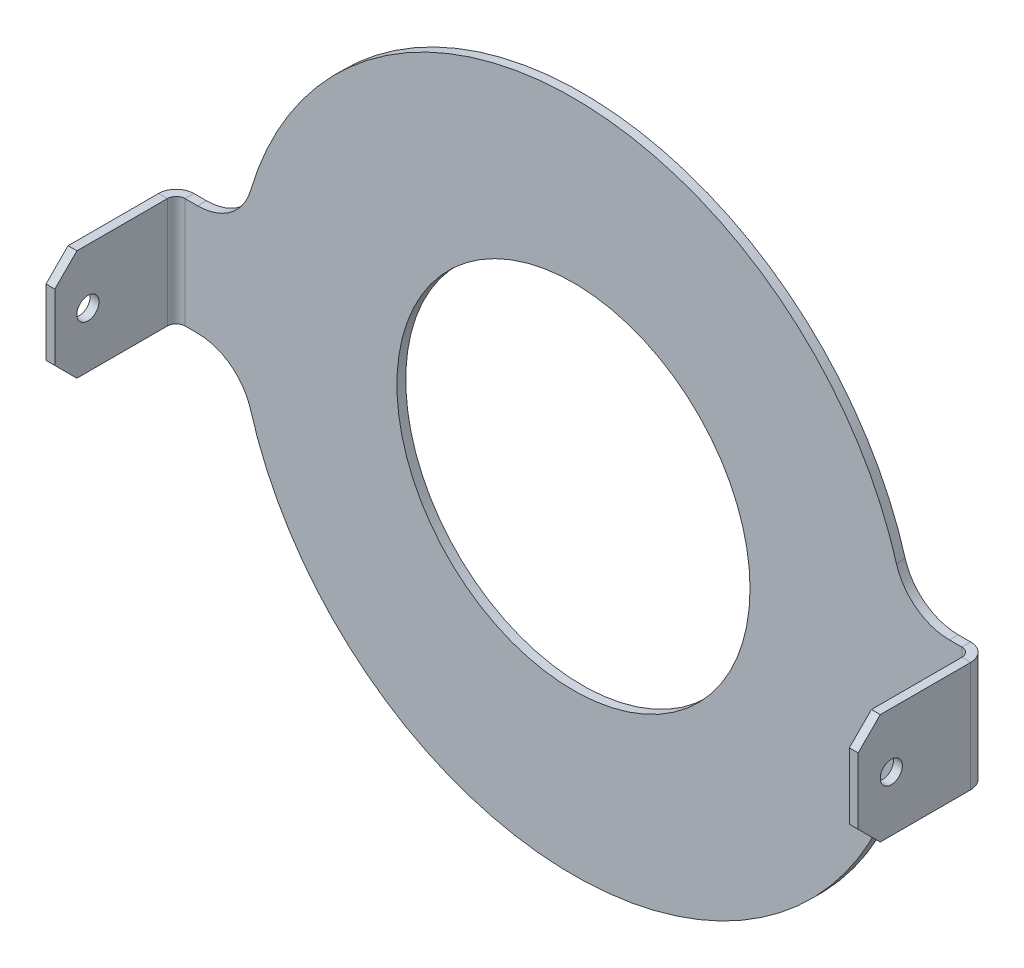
ISO-10303-21;
HEADER;
FILE_DESCRIPTION(('STEP AP214'),'2;1');
FILE_NAME('part.step','',(''),(''),'','','');
FILE_SCHEMA(('AUTOMOTIVE_DESIGN { 1 0 10303 214 1 1 1 1 }'));
ENDSEC;
DATA;
#1=APPLICATION_CONTEXT('core data for automotive mechanical design processes');
#2=APPLICATION_PROTOCOL_DEFINITION('international standard','automotive_design',2000,#1);
#3=PRODUCT_CONTEXT('',#1,'mechanical');
#4=PRODUCT('Part','Part','',(#3));
#5=PRODUCT_RELATED_PRODUCT_CATEGORY('part','',(#4));
#6=PRODUCT_DEFINITION_FORMATION('','',#4);
#7=PRODUCT_DEFINITION_CONTEXT('part definition',#1,'design');
#8=PRODUCT_DEFINITION('design','',#6,#7);
#9=PRODUCT_DEFINITION_SHAPE('','',#8);
#10=(LENGTH_UNIT() NAMED_UNIT(*) SI_UNIT(.MILLI.,.METRE.));
#11=(NAMED_UNIT(*) PLANE_ANGLE_UNIT() SI_UNIT($,.RADIAN.));
#12=(NAMED_UNIT(*) SI_UNIT($,.STERADIAN.) SOLID_ANGLE_UNIT());
#13=UNCERTAINTY_MEASURE_WITH_UNIT(LENGTH_MEASURE(1.E-05),#10,'distance_accuracy_value','');
#14=(GEOMETRIC_REPRESENTATION_CONTEXT(3) GLOBAL_UNCERTAINTY_ASSIGNED_CONTEXT((#13)) GLOBAL_UNIT_ASSIGNED_CONTEXT((#10,
#11,#12)) REPRESENTATION_CONTEXT('',''));
#15=CARTESIAN_POINT('',(0.,0.,0.));
#16=DIRECTION('',(0.,0.,1.));
#17=DIRECTION('',(1.,0.,0.));
#18=AXIS2_PLACEMENT_3D('',#15,#16,#17);
#19=CARTESIAN_POINT('',(0.,0.,4.));
#20=DIRECTION('',(0.,0.,1.));
#21=DIRECTION('',(1.,0.,0.));
#22=AXIS2_PLACEMENT_3D('',#19,#20,#21);
#23=PLANE('',#22);
#24=CARTESIAN_POINT('',(0.,0.,4.));
#25=DIRECTION('',(0.,0.,1.));
#26=DIRECTION('',(1.,0.,0.));
#27=AXIS2_PLACEMENT_3D('',#24,#25,#26);
#28=CIRCLE('',#27,80.);
#29=CARTESIAN_POINT('',(80.,0.,4.));
#30=VERTEX_POINT('',#29);
#31=EDGE_CURVE('E291',#30,#30,#28,.T.);
#32=ORIENTED_EDGE('',*,*,#31,.F.);
#33=EDGE_LOOP('',(#32));
#34=FACE_BOUND('',#33,.T.);
#35=DIRECTION('',(-1.,0.,0.));
#36=VECTOR('',#35,1.);
#37=CARTESIAN_POINT('',(235.,-25.,4.));
#38=LINE('',#37,#36);
#39=CARTESIAN_POINT('',(175.997610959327,-25.,4.));
#40=VERTEX_POINT('',#39);
#41=CARTESIAN_POINT('',(170.312213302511,-25.,4.));
#42=VERTEX_POINT('',#41);
#43=EDGE_CURVE('E289',#40,#42,#38,.T.);
#44=ORIENTED_EDGE('',*,*,#43,.F.);
#45=DIRECTION('',(0.,1.,0.));
#46=VECTOR('',#45,1.);
#47=CARTESIAN_POINT('',(175.997610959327,0.,4.));
#48=LINE('',#47,#46);
#49=CARTESIAN_POINT('',(175.997610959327,25.,4.));
#50=VERTEX_POINT('',#49);
#51=EDGE_CURVE('E242',#40,#50,#48,.T.);
#52=ORIENTED_EDGE('',*,*,#51,.T.);
#53=DIRECTION('',(1.,0.,0.));
#54=VECTOR('',#53,1.);
#55=CARTESIAN_POINT('',(235.,25.,4.));
#56=LINE('',#55,#54);
#57=CARTESIAN_POINT('',(170.312213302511,25.,4.));
#58=VERTEX_POINT('',#57);
#59=EDGE_CURVE('E338',#58,#50,#56,.T.);
#60=ORIENTED_EDGE('',*,*,#59,.F.);
#61=CARTESIAN_POINT('',(170.312213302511,50.,4.));
#62=DIRECTION('',(0.,0.,1.));
#63=DIRECTION('',(1.,0.,0.));
#64=AXIS2_PLACEMENT_3D('',#61,#62,#63);
#65=CIRCLE('',#64,25.);
#66=CARTESIAN_POINT('',(146.324577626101,42.9577464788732,4.));
#67=VERTEX_POINT('',#66);
#68=EDGE_CURVE('E397',#58,#67,#65,.F.);
#69=ORIENTED_EDGE('',*,*,#68,.T.);
#70=CARTESIAN_POINT('',(0.,0.,4.));
#71=DIRECTION('',(0.,0.,1.));
#72=DIRECTION('',(1.,0.,0.));
#73=AXIS2_PLACEMENT_3D('',#70,#71,#72);
#74=CIRCLE('',#73,152.5);
#75=CARTESIAN_POINT('',(-146.324577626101,42.9577464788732,4.));
#76=VERTEX_POINT('',#75);
#77=EDGE_CURVE('E279',#67,#76,#74,.T.);
#78=ORIENTED_EDGE('',*,*,#77,.T.);
#79=CARTESIAN_POINT('',(-170.312213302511,50.,4.));
#80=DIRECTION('',(0.,0.,1.));
#81=DIRECTION('',(1.,0.,0.));
#82=AXIS2_PLACEMENT_3D('',#79,#80,#81);
#83=CIRCLE('',#82,25.);
#84=CARTESIAN_POINT('',(-170.312213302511,25.,4.));
#85=VERTEX_POINT('',#84);
#86=EDGE_CURVE('E405',#76,#85,#83,.F.);
#87=ORIENTED_EDGE('',*,*,#86,.T.);
#88=DIRECTION('',(-1.,0.,0.));
#89=VECTOR('',#88,1.);
#90=CARTESIAN_POINT('',(-235.,25.,4.));
#91=LINE('',#90,#89);
#92=CARTESIAN_POINT('',(-175.997610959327,25.,4.));
#93=VERTEX_POINT('',#92);
#94=EDGE_CURVE('E277',#85,#93,#91,.T.);
#95=ORIENTED_EDGE('',*,*,#94,.T.);
#96=DIRECTION('',(0.,1.,0.));
#97=VECTOR('',#96,1.);
#98=CARTESIAN_POINT('',(-175.997610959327,0.,4.));
#99=LINE('',#98,#97);
#100=CARTESIAN_POINT('',(-175.997610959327,-25.,4.));
#101=VERTEX_POINT('',#100);
#102=EDGE_CURVE('E259',#101,#93,#99,.T.);
#103=ORIENTED_EDGE('',*,*,#102,.F.);
#104=DIRECTION('',(1.,0.,0.));
#105=VECTOR('',#104,1.);
#106=CARTESIAN_POINT('',(-235.,-25.,4.));
#107=LINE('',#106,#105);
#108=CARTESIAN_POINT('',(-170.312213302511,-25.,4.));
#109=VERTEX_POINT('',#108);
#110=EDGE_CURVE('E283',#101,#109,#107,.T.);
#111=ORIENTED_EDGE('',*,*,#110,.T.);
#112=CARTESIAN_POINT('',(-170.312213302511,-50.,4.));
#113=DIRECTION('',(0.,0.,1.));
#114=DIRECTION('',(1.,0.,0.));
#115=AXIS2_PLACEMENT_3D('',#112,#113,#114);
#116=CIRCLE('',#115,25.);
#117=CARTESIAN_POINT('',(-146.324577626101,-42.9577464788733,4.));
#118=VERTEX_POINT('',#117);
#119=EDGE_CURVE('E52',#109,#118,#116,.F.);
#120=ORIENTED_EDGE('',*,*,#119,.T.);
#121=CARTESIAN_POINT('',(146.324577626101,-42.9577464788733,4.));
#122=VERTEX_POINT('',#121);
#123=EDGE_CURVE('E280',#118,#122,#74,.T.);
#124=ORIENTED_EDGE('',*,*,#123,.T.);
#125=CARTESIAN_POINT('',(170.312213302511,-50.,4.));
#126=DIRECTION('',(0.,0.,1.));
#127=DIRECTION('',(1.,0.,0.));
#128=AXIS2_PLACEMENT_3D('',#125,#126,#127);
#129=CIRCLE('',#128,25.);
#130=EDGE_CURVE('E401',#122,#42,#129,.F.);
#131=ORIENTED_EDGE('',*,*,#130,.T.);
#132=EDGE_LOOP('',(#44,#52,#60,#69,#78,#87,#95,#103,#111,#120,#124,#131));
#133=FACE_BOUND('',#132,.T.);
#134=ADVANCED_FACE('F44',(#34,#133),#23,.T.);
#135=CARTESIAN_POINT('',(-179.997610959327,0.,-176.002389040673));
#136=DIRECTION('',(1.,0.,0.));
#137=DIRECTION('',(0.,0.,-1.));
#138=AXIS2_PLACEMENT_3D('',#135,#136,#137);
#139=PLANE('',#138);
#140=CARTESIAN_POINT('',(-179.997610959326,0.,43.9976109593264));
#141=DIRECTION('',(1.,0.,0.));
#142=DIRECTION('',(0.,0.,-1.));
#143=AXIS2_PLACEMENT_3D('',#140,#141,#142);
#144=CIRCLE('',#143,5.);
#145=CARTESIAN_POINT('',(-179.997610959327,0.,38.9976109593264));
#146=VERTEX_POINT('',#145);
#147=EDGE_CURVE('E227',#146,#146,#144,.T.);
#148=ORIENTED_EDGE('',*,*,#147,.F.);
#149=EDGE_LOOP('',(#148));
#150=FACE_BOUND('',#149,.T.);
#151=DIRECTION('',(0.,-1.,0.));
#152=VECTOR('',#151,1.);
#153=CARTESIAN_POINT('',(-179.997610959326,25.,58.9976109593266));
#154=LINE('',#153,#152);
#155=CARTESIAN_POINT('',(-179.997610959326,15.,58.9976109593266));
#156=VERTEX_POINT('',#155);
#157=CARTESIAN_POINT('',(-179.997610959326,-15.0000000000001,58.9976109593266));
#158=VERTEX_POINT('',#157);
#159=EDGE_CURVE('E266',#156,#158,#154,.T.);
#160=ORIENTED_EDGE('',*,*,#159,.T.);
#161=DIRECTION('',(0.,0.707106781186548,0.707106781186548));
#162=VECTOR('',#161,1.);
#163=CARTESIAN_POINT('',(-179.997610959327,-125.,-51.0023890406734));
#164=LINE('',#163,#162);
#165=CARTESIAN_POINT('',(-179.997610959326,-25.,48.9976109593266));
#166=VERTEX_POINT('',#165);
#167=EDGE_CURVE('E356',#158,#166,#164,.F.);
#168=ORIENTED_EDGE('',*,*,#167,.T.);
#169=DIRECTION('',(0.,0.,-1.));
#170=VECTOR('',#169,1.);
#171=CARTESIAN_POINT('',(-179.997610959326,-25.,58.9976109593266));
#172=LINE('',#171,#170);
#173=CARTESIAN_POINT('',(-179.997610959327,-25.,8.00000000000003));
#174=VERTEX_POINT('',#173);
#175=EDGE_CURVE('E309',#166,#174,#172,.T.);
#176=ORIENTED_EDGE('',*,*,#175,.T.);
#177=DIRECTION('',(0.,1.,0.));
#178=VECTOR('',#177,1.);
#179=CARTESIAN_POINT('',(-179.997610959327,0.,8.00000000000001));
#180=LINE('',#179,#178);
#181=CARTESIAN_POINT('',(-179.997610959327,25.,8.00000000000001));
#182=VERTEX_POINT('',#181);
#183=EDGE_CURVE('E310',#174,#182,#180,.T.);
#184=ORIENTED_EDGE('',*,*,#183,.T.);
#185=DIRECTION('',(0.,0.,1.));
#186=VECTOR('',#185,1.);
#187=CARTESIAN_POINT('',(-179.997610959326,25.,58.9976109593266));
#188=LINE('',#187,#186);
#189=CARTESIAN_POINT('',(-179.997610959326,25.,48.9976109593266));
#190=VERTEX_POINT('',#189);
#191=EDGE_CURVE('E306',#182,#190,#188,.T.);
#192=ORIENTED_EDGE('',*,*,#191,.T.);
#193=DIRECTION('',(0.,0.707106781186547,-0.707106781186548));
#194=VECTOR('',#193,1.);
#195=CARTESIAN_POINT('',(-179.997610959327,125.,-51.0023890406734));
#196=LINE('',#195,#194);
#197=EDGE_CURVE('E347',#190,#156,#196,.F.);
#198=ORIENTED_EDGE('',*,*,#197,.T.);
#199=EDGE_LOOP('',(#160,#168,#176,#184,#192,#198));
#200=FACE_BOUND('',#199,.T.);
#201=ADVANCED_FACE('F448',(#150,#200),#139,.T.);
#202=CARTESIAN_POINT('',(-183.997610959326,25.,58.9976109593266));
#203=DIRECTION('',(0.,1.,0.));
#204=DIRECTION('',(0.,0.,1.));
#205=AXIS2_PLACEMENT_3D('',#202,#203,#204);
#206=PLANE('',#205);
#207=DIRECTION('',(0.,0.,1.));
#208=VECTOR('',#207,1.);
#209=CARTESIAN_POINT('',(-183.997610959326,25.,58.9976109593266));
#210=LINE('',#209,#208);
#211=CARTESIAN_POINT('',(-183.997610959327,25.,8.00000000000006));
#212=VERTEX_POINT('',#211);
#213=CARTESIAN_POINT('',(-183.997610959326,25.,48.9976109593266));
#214=VERTEX_POINT('',#213);
#215=EDGE_CURVE('E314',#212,#214,#210,.T.);
#216=ORIENTED_EDGE('',*,*,#215,.T.);
#217=DIRECTION('',(1.,0.,0.));
#218=VECTOR('',#217,1.);
#219=CARTESIAN_POINT('',(-183.997610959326,25.,48.9976109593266));
#220=LINE('',#219,#218);
#221=EDGE_CURVE('E337',#214,#190,#220,.T.);
#222=ORIENTED_EDGE('',*,*,#221,.T.);
#223=ORIENTED_EDGE('',*,*,#191,.F.);
#224=DIRECTION('',(-1.,0.,0.));
#225=VECTOR('',#224,1.);
#226=CARTESIAN_POINT('',(-183.997610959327,25.,8.00000000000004));
#227=LINE('',#226,#225);
#228=EDGE_CURVE('E319',#182,#212,#227,.T.);
#229=ORIENTED_EDGE('',*,*,#228,.T.);
#230=EDGE_LOOP('',(#216,#222,#223,#229));
#231=FACE_BOUND('',#230,.T.);
#232=ADVANCED_FACE('F445',(#231),#206,.T.);
#233=CARTESIAN_POINT('',(-183.997610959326,-25.,58.9976109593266));
#234=DIRECTION('',(0.,-1.,0.));
#235=DIRECTION('',(0.,0.,-1.));
#236=AXIS2_PLACEMENT_3D('',#233,#234,#235);
#237=PLANE('',#236);
#238=ORIENTED_EDGE('',*,*,#175,.F.);
#239=DIRECTION('',(-1.,0.,0.));
#240=VECTOR('',#239,1.);
#241=CARTESIAN_POINT('',(-183.997610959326,-25.,48.9976109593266));
#242=LINE('',#241,#240);
#243=CARTESIAN_POINT('',(-183.997610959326,-25.,48.9976109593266));
#244=VERTEX_POINT('',#243);
#245=EDGE_CURVE('E358',#166,#244,#242,.T.);
#246=ORIENTED_EDGE('',*,*,#245,.T.);
#247=DIRECTION('',(0.,0.,-1.));
#248=VECTOR('',#247,1.);
#249=CARTESIAN_POINT('',(-183.997610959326,-25.,58.9976109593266));
#250=LINE('',#249,#248);
#251=CARTESIAN_POINT('',(-183.997610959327,-25.,8.00000000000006));
#252=VERTEX_POINT('',#251);
#253=EDGE_CURVE('E305',#244,#252,#250,.T.);
#254=ORIENTED_EDGE('',*,*,#253,.T.);
#255=DIRECTION('',(1.,0.,0.));
#256=VECTOR('',#255,1.);
#257=CARTESIAN_POINT('',(-183.997610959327,-25.,8.00000000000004));
#258=LINE('',#257,#256);
#259=EDGE_CURVE('E313',#252,#174,#258,.T.);
#260=ORIENTED_EDGE('',*,*,#259,.T.);
#261=EDGE_LOOP('',(#238,#246,#254,#260));
#262=FACE_BOUND('',#261,.T.);
#263=ADVANCED_FACE('F457',(#262),#237,.T.);
#264=CARTESIAN_POINT('',(-183.997610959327,0.,-176.002389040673));
#265=DIRECTION('',(1.,0.,0.));
#266=DIRECTION('',(0.,0.,-1.));
#267=AXIS2_PLACEMENT_3D('',#264,#265,#266);
#268=PLANE('',#267);
#269=CARTESIAN_POINT('',(-183.997610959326,0.,43.9976109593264));
#270=DIRECTION('',(-1.,0.,0.));
#271=DIRECTION('',(0.,0.,1.));
#272=AXIS2_PLACEMENT_3D('',#269,#270,#271);
#273=CIRCLE('',#272,5.);
#274=CARTESIAN_POINT('',(-183.997610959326,0.,48.9976109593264));
#275=VERTEX_POINT('',#274);
#276=EDGE_CURVE('E542',#275,#275,#273,.T.);
#277=ORIENTED_EDGE('',*,*,#276,.F.);
#278=EDGE_LOOP('',(#277));
#279=FACE_BOUND('',#278,.T.);
#280=ORIENTED_EDGE('',*,*,#253,.F.);
#281=DIRECTION('',(0.,-0.707106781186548,-0.707106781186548));
#282=VECTOR('',#281,1.);
#283=CARTESIAN_POINT('',(-183.997610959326,-15.,58.9976109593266));
#284=LINE('',#283,#282);
#285=CARTESIAN_POINT('',(-183.997610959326,-15.,58.9976109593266));
#286=VERTEX_POINT('',#285);
#287=EDGE_CURVE('E360',#244,#286,#284,.F.);
#288=ORIENTED_EDGE('',*,*,#287,.T.);
#289=DIRECTION('',(0.,-1.,0.));
#290=VECTOR('',#289,1.);
#291=CARTESIAN_POINT('',(-183.997610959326,25.,58.9976109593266));
#292=LINE('',#291,#290);
#293=CARTESIAN_POINT('',(-183.997610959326,15.,58.9976109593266));
#294=VERTEX_POINT('',#293);
#295=EDGE_CURVE('E302',#294,#286,#292,.T.);
#296=ORIENTED_EDGE('',*,*,#295,.F.);
#297=DIRECTION('',(0.,-0.707106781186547,0.707106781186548));
#298=VECTOR('',#297,1.);
#299=CARTESIAN_POINT('',(-183.997610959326,25.,48.9976109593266));
#300=LINE('',#299,#298);
#301=EDGE_CURVE('E351',#294,#214,#300,.F.);
#302=ORIENTED_EDGE('',*,*,#301,.T.);
#303=ORIENTED_EDGE('',*,*,#215,.F.);
#304=DIRECTION('',(0.,1.,0.));
#305=VECTOR('',#304,1.);
#306=CARTESIAN_POINT('',(-183.997610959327,0.,8.00000000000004));
#307=LINE('',#306,#305);
#308=EDGE_CURVE('E317',#252,#212,#307,.T.);
#309=ORIENTED_EDGE('',*,*,#308,.F.);
#310=EDGE_LOOP('',(#280,#288,#296,#302,#303,#309));
#311=FACE_BOUND('',#310,.T.);
#312=ADVANCED_FACE('F438',(#279,#311),#268,.F.);
#313=CARTESIAN_POINT('',(-183.997610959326,25.,58.9976109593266));
#314=DIRECTION('',(0.,0.,1.));
#315=DIRECTION('',(1.,0.,0.));
#316=AXIS2_PLACEMENT_3D('',#313,#314,#315);
#317=PLANE('',#316);
#318=ORIENTED_EDGE('',*,*,#295,.T.);
#319=DIRECTION('',(1.,0.,0.));
#320=VECTOR('',#319,1.);
#321=CARTESIAN_POINT('',(-183.997610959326,-15.,58.9976109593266));
#322=LINE('',#321,#320);
#323=EDGE_CURVE('E353',#286,#158,#322,.T.);
#324=ORIENTED_EDGE('',*,*,#323,.T.);
#325=ORIENTED_EDGE('',*,*,#159,.F.);
#326=DIRECTION('',(-1.,0.,0.));
#327=VECTOR('',#326,1.);
#328=CARTESIAN_POINT('',(-183.997610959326,15.,58.9976109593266));
#329=LINE('',#328,#327);
#330=EDGE_CURVE('E349',#156,#294,#329,.T.);
#331=ORIENTED_EDGE('',*,*,#330,.T.);
#332=EDGE_LOOP('',(#318,#324,#325,#331));
#333=FACE_BOUND('',#332,.T.);
#334=ADVANCED_FACE('F463',(#333),#317,.T.);
#335=CARTESIAN_POINT('',(0.,0.,0.));
#336=DIRECTION('',(0.,0.,1.));
#337=DIRECTION('',(1.,0.,0.));
#338=AXIS2_PLACEMENT_3D('',#335,#336,#337);
#339=CYLINDRICAL_SURFACE('',#338,80.);
#340=CARTESIAN_POINT('',(0.,0.,0.));
#341=DIRECTION('',(0.,0.,1.));
#342=DIRECTION('',(1.,0.,0.));
#343=AXIS2_PLACEMENT_3D('',#340,#341,#342);
#344=CIRCLE('',#343,80.);
#345=CARTESIAN_POINT('',(80.,0.,0.));
#346=VERTEX_POINT('',#345);
#347=EDGE_CURVE('E272',#346,#346,#344,.T.);
#348=ORIENTED_EDGE('',*,*,#347,.F.);
#349=EDGE_LOOP('',(#348));
#350=FACE_BOUND('',#349,.T.);
#351=ORIENTED_EDGE('',*,*,#31,.T.);
#352=EDGE_LOOP('',(#351));
#353=FACE_BOUND('',#352,.T.);
#354=ADVANCED_FACE('F506',(#350,#353),#339,.F.);
#355=CARTESIAN_POINT('',(0.,0.,4.));
#356=DIRECTION('',(0.,0.,-1.));
#357=DIRECTION('',(-1.,0.,0.));
#358=AXIS2_PLACEMENT_3D('',#355,#356,#357);
#359=CYLINDRICAL_SURFACE('',#358,152.5);
#360=ORIENTED_EDGE('',*,*,#77,.F.);
#361=DIRECTION('',(0.,0.,-1.));
#362=VECTOR('',#361,1.);
#363=CARTESIAN_POINT('',(146.324577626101,42.9577464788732,4.));
#364=LINE('',#363,#362);
#365=CARTESIAN_POINT('',(146.324577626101,42.9577464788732,0.));
#366=VERTEX_POINT('',#365);
#367=EDGE_CURVE('E384',#67,#366,#364,.T.);
#368=ORIENTED_EDGE('',*,*,#367,.T.);
#369=CARTESIAN_POINT('',(0.,0.,0.));
#370=DIRECTION('',(0.,0.,1.));
#371=DIRECTION('',(1.,0.,0.));
#372=AXIS2_PLACEMENT_3D('',#369,#370,#371);
#373=CIRCLE('',#372,152.5);
#374=CARTESIAN_POINT('',(-146.324577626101,42.9577464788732,0.));
#375=VERTEX_POINT('',#374);
#376=EDGE_CURVE('E290',#366,#375,#373,.T.);
#377=ORIENTED_EDGE('',*,*,#376,.T.);
#378=DIRECTION('',(0.,0.,-1.));
#379=VECTOR('',#378,1.);
#380=CARTESIAN_POINT('',(-146.324577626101,42.9577464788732,4.));
#381=LINE('',#380,#379);
#382=EDGE_CURVE('E381',#375,#76,#381,.F.);
#383=ORIENTED_EDGE('',*,*,#382,.T.);
#384=EDGE_LOOP('',(#360,#368,#377,#383));
#385=FACE_BOUND('',#384,.T.);
#386=ADVANCED_FACE('F501',(#385),#359,.T.);
#387=CARTESIAN_POINT('',(235.,25.,0.));
#388=DIRECTION('',(0.,-1.,0.));
#389=DIRECTION('',(1.,0.,0.));
#390=AXIS2_PLACEMENT_3D('',#387,#388,#389);
#391=PLANE('',#390);
#392=DIRECTION('',(1.,0.,0.));
#393=VECTOR('',#392,1.);
#394=CARTESIAN_POINT('',(235.,25.,0.));
#395=LINE('',#394,#393);
#396=CARTESIAN_POINT('',(170.312213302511,25.,0.));
#397=VERTEX_POINT('',#396);
#398=CARTESIAN_POINT('',(175.997610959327,25.,0.));
#399=VERTEX_POINT('',#398);
#400=EDGE_CURVE('E271',#397,#399,#395,.T.);
#401=ORIENTED_EDGE('',*,*,#400,.F.);
#402=DIRECTION('',(0.,0.,1.));
#403=VECTOR('',#402,1.);
#404=CARTESIAN_POINT('',(170.312213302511,25.,4.));
#405=LINE('',#404,#403);
#406=EDGE_CURVE('E378',#397,#58,#405,.T.);
#407=ORIENTED_EDGE('',*,*,#406,.T.);
#408=ORIENTED_EDGE('',*,*,#59,.T.);
#409=DIRECTION('',(0.,0.,1.));
#410=VECTOR('',#409,1.);
#411=CARTESIAN_POINT('',(175.997610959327,25.,0.));
#412=LINE('',#411,#410);
#413=EDGE_CURVE('E334',#399,#50,#412,.T.);
#414=ORIENTED_EDGE('',*,*,#413,.F.);
#415=EDGE_LOOP('',(#401,#407,#408,#414));
#416=FACE_BOUND('',#415,.T.);
#417=ADVANCED_FACE('F496',(#416),#391,.F.);
#418=CARTESIAN_POINT('',(235.,-25.,0.));
#419=DIRECTION('',(0.,1.,0.));
#420=DIRECTION('',(-1.,0.,0.));
#421=AXIS2_PLACEMENT_3D('',#418,#419,#420);
#422=PLANE('',#421);
#423=ORIENTED_EDGE('',*,*,#43,.T.);
#424=DIRECTION('',(0.,0.,1.));
#425=VECTOR('',#424,1.);
#426=CARTESIAN_POINT('',(170.312213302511,-25.,0.));
#427=LINE('',#426,#425);
#428=CARTESIAN_POINT('',(170.312213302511,-25.,0.));
#429=VERTEX_POINT('',#428);
#430=EDGE_CURVE('E391',#42,#429,#427,.F.);
#431=ORIENTED_EDGE('',*,*,#430,.T.);
#432=DIRECTION('',(-1.,0.,0.));
#433=VECTOR('',#432,1.);
#434=CARTESIAN_POINT('',(235.,-25.,0.));
#435=LINE('',#434,#433);
#436=CARTESIAN_POINT('',(175.997610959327,-25.,0.));
#437=VERTEX_POINT('',#436);
#438=EDGE_CURVE('E267',#437,#429,#435,.T.);
#439=ORIENTED_EDGE('',*,*,#438,.F.);
#440=DIRECTION('',(0.,0.,-1.));
#441=VECTOR('',#440,1.);
#442=CARTESIAN_POINT('',(175.997610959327,-25.,0.));
#443=LINE('',#442,#441);
#444=EDGE_CURVE('E329',#40,#437,#443,.T.);
#445=ORIENTED_EDGE('',*,*,#444,.F.);
#446=EDGE_LOOP('',(#423,#431,#439,#445));
#447=FACE_BOUND('',#446,.T.);
#448=ADVANCED_FACE('F493',(#447),#422,.F.);
#449=CARTESIAN_POINT('',(-146.324577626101,-42.9577464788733,0.));
#450=VERTEX_POINT('',#449);
#451=CARTESIAN_POINT('',(146.324577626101,-42.9577464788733,0.));
#452=VERTEX_POINT('',#451);
#453=EDGE_CURVE('E286',#450,#452,#373,.T.);
#454=ORIENTED_EDGE('',*,*,#453,.T.);
#455=DIRECTION('',(0.,0.,-1.));
#456=VECTOR('',#455,1.);
#457=CARTESIAN_POINT('',(146.324577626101,-42.9577464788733,4.));
#458=LINE('',#457,#456);
#459=EDGE_CURVE('E388',#452,#122,#458,.F.);
#460=ORIENTED_EDGE('',*,*,#459,.T.);
#461=ORIENTED_EDGE('',*,*,#123,.F.);
#462=DIRECTION('',(0.,0.,-1.));
#463=VECTOR('',#462,1.);
#464=CARTESIAN_POINT('',(-146.324577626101,-42.9577464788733,4.));
#465=LINE('',#464,#463);
#466=EDGE_CURVE('E386',#118,#450,#465,.T.);
#467=ORIENTED_EDGE('',*,*,#466,.T.);
#468=EDGE_LOOP('',(#454,#460,#461,#467));
#469=FACE_BOUND('',#468,.T.);
#470=ADVANCED_FACE('F412',(#469),#359,.T.);
#471=CARTESIAN_POINT('',(-235.,-25.,0.));
#472=DIRECTION('',(0.,-1.,0.));
#473=DIRECTION('',(1.,0.,0.));
#474=AXIS2_PLACEMENT_3D('',#471,#472,#473);
#475=PLANE('',#474);
#476=DIRECTION('',(1.,0.,0.));
#477=VECTOR('',#476,1.);
#478=CARTESIAN_POINT('',(-235.,-25.,0.));
#479=LINE('',#478,#477);
#480=CARTESIAN_POINT('',(-175.997610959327,-25.,0.));
#481=VERTEX_POINT('',#480);
#482=CARTESIAN_POINT('',(-170.312213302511,-25.,0.));
#483=VERTEX_POINT('',#482);
#484=EDGE_CURVE('E275',#481,#483,#479,.T.);
#485=ORIENTED_EDGE('',*,*,#484,.T.);
#486=DIRECTION('',(0.,0.,-1.));
#487=VECTOR('',#486,1.);
#488=CARTESIAN_POINT('',(-170.312213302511,-25.,0.));
#489=LINE('',#488,#487);
#490=EDGE_CURVE('E395',#483,#109,#489,.F.);
#491=ORIENTED_EDGE('',*,*,#490,.T.);
#492=ORIENTED_EDGE('',*,*,#110,.F.);
#493=DIRECTION('',(0.,0.,1.));
#494=VECTOR('',#493,1.);
#495=CARTESIAN_POINT('',(-175.997610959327,-25.,0.));
#496=LINE('',#495,#494);
#497=EDGE_CURVE('E294',#481,#101,#496,.T.);
#498=ORIENTED_EDGE('',*,*,#497,.F.);
#499=EDGE_LOOP('',(#485,#491,#492,#498));
#500=FACE_BOUND('',#499,.T.);
#501=ADVANCED_FACE('F415',(#500),#475,.T.);
#502=CARTESIAN_POINT('',(0.,0.,0.));
#503=DIRECTION('',(0.,0.,1.));
#504=DIRECTION('',(1.,0.,0.));
#505=AXIS2_PLACEMENT_3D('',#502,#503,#504);
#506=PLANE('',#505);
#507=DIRECTION('',(0.,1.,0.));
#508=VECTOR('',#507,1.);
#509=CARTESIAN_POINT('',(175.997610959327,0.,0.));
#510=LINE('',#509,#508);
#511=EDGE_CURVE('E331',#437,#399,#510,.T.);
#512=ORIENTED_EDGE('',*,*,#511,.F.);
#513=ORIENTED_EDGE('',*,*,#438,.T.);
#514=CARTESIAN_POINT('',(170.312213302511,-50.,0.));
#515=DIRECTION('',(0.,0.,1.));
#516=DIRECTION('',(1.,0.,0.));
#517=AXIS2_PLACEMENT_3D('',#514,#515,#516);
#518=CIRCLE('',#517,25.);
#519=EDGE_CURVE('E403',#429,#452,#518,.T.);
#520=ORIENTED_EDGE('',*,*,#519,.T.);
#521=ORIENTED_EDGE('',*,*,#453,.F.);
#522=CARTESIAN_POINT('',(-170.312213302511,-50.,0.));
#523=DIRECTION('',(0.,0.,1.));
#524=DIRECTION('',(1.,0.,0.));
#525=AXIS2_PLACEMENT_3D('',#522,#523,#524);
#526=CIRCLE('',#525,25.);
#527=EDGE_CURVE('E12',#450,#483,#526,.T.);
#528=ORIENTED_EDGE('',*,*,#527,.T.);
#529=ORIENTED_EDGE('',*,*,#484,.F.);
#530=DIRECTION('',(0.,1.,0.));
#531=VECTOR('',#530,1.);
#532=CARTESIAN_POINT('',(-175.997610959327,0.,0.));
#533=LINE('',#532,#531);
#534=CARTESIAN_POINT('',(-175.997610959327,25.,0.));
#535=VERTEX_POINT('',#534);
#536=EDGE_CURVE('E268',#481,#535,#533,.T.);
#537=ORIENTED_EDGE('',*,*,#536,.T.);
#538=DIRECTION('',(-1.,0.,0.));
#539=VECTOR('',#538,1.);
#540=CARTESIAN_POINT('',(-235.,25.,0.));
#541=LINE('',#540,#539);
#542=CARTESIAN_POINT('',(-170.312213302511,25.,0.));
#543=VERTEX_POINT('',#542);
#544=EDGE_CURVE('E264',#543,#535,#541,.T.);
#545=ORIENTED_EDGE('',*,*,#544,.F.);
#546=CARTESIAN_POINT('',(-170.312213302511,50.,0.));
#547=DIRECTION('',(0.,0.,1.));
#548=DIRECTION('',(1.,0.,0.));
#549=AXIS2_PLACEMENT_3D('',#546,#547,#548);
#550=CIRCLE('',#549,25.);
#551=EDGE_CURVE('E407',#543,#375,#550,.T.);
#552=ORIENTED_EDGE('',*,*,#551,.T.);
#553=ORIENTED_EDGE('',*,*,#376,.F.);
#554=CARTESIAN_POINT('',(170.312213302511,50.,0.));
#555=DIRECTION('',(0.,0.,1.));
#556=DIRECTION('',(1.,0.,0.));
#557=AXIS2_PLACEMENT_3D('',#554,#555,#556);
#558=CIRCLE('',#557,25.);
#559=EDGE_CURVE('E399',#366,#397,#558,.T.);
#560=ORIENTED_EDGE('',*,*,#559,.T.);
#561=ORIENTED_EDGE('',*,*,#400,.T.);
#562=EDGE_LOOP('',(#512,#513,#520,#521,#528,#529,#537,#545,#552,#553,#560,#561));
#563=FACE_BOUND('',#562,.T.);
#564=ORIENTED_EDGE('',*,*,#347,.T.);
#565=EDGE_LOOP('',(#564));
#566=FACE_BOUND('',#565,.T.);
#567=ADVANCED_FACE('F419',(#563,#566),#506,.F.);
#568=CARTESIAN_POINT('',(-235.,25.,0.));
#569=DIRECTION('',(0.,1.,0.));
#570=DIRECTION('',(-1.,0.,0.));
#571=AXIS2_PLACEMENT_3D('',#568,#569,#570);
#572=PLANE('',#571);
#573=ORIENTED_EDGE('',*,*,#94,.F.);
#574=DIRECTION('',(0.,0.,-1.));
#575=VECTOR('',#574,1.);
#576=CARTESIAN_POINT('',(-170.312213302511,25.,0.));
#577=LINE('',#576,#575);
#578=EDGE_CURVE('E393',#85,#543,#577,.T.);
#579=ORIENTED_EDGE('',*,*,#578,.T.);
#580=ORIENTED_EDGE('',*,*,#544,.T.);
#581=DIRECTION('',(0.,0.,-1.));
#582=VECTOR('',#581,1.);
#583=CARTESIAN_POINT('',(-175.997610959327,25.,0.));
#584=LINE('',#583,#582);
#585=EDGE_CURVE('E297',#93,#535,#584,.T.);
#586=ORIENTED_EDGE('',*,*,#585,.F.);
#587=EDGE_LOOP('',(#573,#579,#580,#586));
#588=FACE_BOUND('',#587,.T.);
#589=ADVANCED_FACE('F499',(#588),#572,.T.);
#590=CARTESIAN_POINT('',(-175.997610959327,-25.,8.));
#591=DIRECTION('',(0.,1.,0.));
#592=DIRECTION('',(0.,0.,1.));
#593=AXIS2_PLACEMENT_3D('',#590,#591,#592);
#594=PLANE('',#593);
#595=ORIENTED_EDGE('',*,*,#259,.F.);
#596=CARTESIAN_POINT('',(-175.997610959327,-25.,8.));
#597=DIRECTION('',(0.,-1.,0.));
#598=DIRECTION('',(0.,0.,-1.));
#599=AXIS2_PLACEMENT_3D('',#596,#597,#598);
#600=CIRCLE('',#599,8.);
#601=EDGE_CURVE('E246',#252,#481,#600,.T.);
#602=ORIENTED_EDGE('',*,*,#601,.T.);
#603=ORIENTED_EDGE('',*,*,#497,.T.);
#604=CARTESIAN_POINT('',(-175.997610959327,-25.,8.));
#605=DIRECTION('',(0.,-1.,0.));
#606=DIRECTION('',(0.,0.,-1.));
#607=AXIS2_PLACEMENT_3D('',#604,#605,#606);
#608=CIRCLE('',#607,4.);
#609=EDGE_CURVE('E253',#174,#101,#608,.T.);
#610=ORIENTED_EDGE('',*,*,#609,.F.);
#611=EDGE_LOOP('',(#595,#602,#603,#610));
#612=FACE_BOUND('',#611,.T.);
#613=ADVANCED_FACE('F455',(#612),#594,.F.);
#614=CARTESIAN_POINT('',(-175.997610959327,25.,8.));
#615=DIRECTION('',(0.,-1.,0.));
#616=DIRECTION('',(0.,0.,-1.));
#617=AXIS2_PLACEMENT_3D('',#614,#615,#616);
#618=PLANE('',#617);
#619=CARTESIAN_POINT('',(-175.997610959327,25.,8.));
#620=DIRECTION('',(0.,-1.,0.));
#621=DIRECTION('',(0.,0.,-1.));
#622=AXIS2_PLACEMENT_3D('',#619,#620,#621);
#623=CIRCLE('',#622,8.);
#624=EDGE_CURVE('E257',#535,#212,#623,.F.);
#625=ORIENTED_EDGE('',*,*,#624,.T.);
#626=ORIENTED_EDGE('',*,*,#228,.F.);
#627=CARTESIAN_POINT('',(-175.997610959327,25.,8.));
#628=DIRECTION('',(0.,1.,0.));
#629=DIRECTION('',(0.,0.,1.));
#630=AXIS2_PLACEMENT_3D('',#627,#628,#629);
#631=CIRCLE('',#630,4.);
#632=EDGE_CURVE('E256',#93,#182,#631,.T.);
#633=ORIENTED_EDGE('',*,*,#632,.F.);
#634=ORIENTED_EDGE('',*,*,#585,.T.);
#635=EDGE_LOOP('',(#625,#626,#633,#634));
#636=FACE_BOUND('',#635,.T.);
#637=ADVANCED_FACE('F429',(#636),#618,.F.);
#638=CARTESIAN_POINT('',(-175.997610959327,50.7944531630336,8.));
#639=DIRECTION('',(0.,-1.,0.));
#640=DIRECTION('',(0.,0.,-1.));
#641=AXIS2_PLACEMENT_3D('',#638,#639,#640);
#642=CYLINDRICAL_SURFACE('',#641,4.);
#643=ORIENTED_EDGE('',*,*,#102,.T.);
#644=ORIENTED_EDGE('',*,*,#632,.T.);
#645=ORIENTED_EDGE('',*,*,#183,.F.);
#646=ORIENTED_EDGE('',*,*,#609,.T.);
#647=EDGE_LOOP('',(#643,#644,#645,#646));
#648=FACE_BOUND('',#647,.T.);
#649=ADVANCED_FACE('F452',(#648),#642,.F.);
#650=CARTESIAN_POINT('',(-175.997610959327,50.7944531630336,8.));
#651=DIRECTION('',(0.,-1.,0.));
#652=DIRECTION('',(0.,0.,-1.));
#653=AXIS2_PLACEMENT_3D('',#650,#651,#652);
#654=CYLINDRICAL_SURFACE('',#653,8.);
#655=ORIENTED_EDGE('',*,*,#536,.F.);
#656=ORIENTED_EDGE('',*,*,#601,.F.);
#657=ORIENTED_EDGE('',*,*,#308,.T.);
#658=ORIENTED_EDGE('',*,*,#624,.F.);
#659=EDGE_LOOP('',(#655,#656,#657,#658));
#660=FACE_BOUND('',#659,.T.);
#661=ADVANCED_FACE('F434',(#660),#654,.T.);
#662=CARTESIAN_POINT('',(175.997610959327,-25.,8.));
#663=DIRECTION('',(0.,1.,0.));
#664=DIRECTION('',(0.,0.,1.));
#665=AXIS2_PLACEMENT_3D('',#662,#663,#664);
#666=PLANE('',#665);
#667=ORIENTED_EDGE('',*,*,#444,.T.);
#668=CARTESIAN_POINT('',(175.997610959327,-25.,8.));
#669=DIRECTION('',(0.,1.,0.));
#670=DIRECTION('',(0.,0.,1.));
#671=AXIS2_PLACEMENT_3D('',#668,#669,#670);
#672=CIRCLE('',#671,8.);
#673=CARTESIAN_POINT('',(183.997610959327,-25.,8.00000000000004));
#674=VERTEX_POINT('',#673);
#675=EDGE_CURVE('E236',#437,#674,#672,.F.);
#676=ORIENTED_EDGE('',*,*,#675,.T.);
#677=DIRECTION('',(1.,0.,0.));
#678=VECTOR('',#677,1.);
#679=CARTESIAN_POINT('',(183.997610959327,-25.,8.00000000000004));
#680=LINE('',#679,#678);
#681=CARTESIAN_POINT('',(179.997610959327,-25.,8.00000000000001));
#682=VERTEX_POINT('',#681);
#683=EDGE_CURVE('E210',#682,#674,#680,.T.);
#684=ORIENTED_EDGE('',*,*,#683,.F.);
#685=CARTESIAN_POINT('',(175.997610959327,-25.,8.));
#686=DIRECTION('',(0.,-1.,0.));
#687=DIRECTION('',(0.,0.,1.));
#688=AXIS2_PLACEMENT_3D('',#685,#686,#687);
#689=CIRCLE('',#688,4.);
#690=EDGE_CURVE('E234',#40,#682,#689,.T.);
#691=ORIENTED_EDGE('',*,*,#690,.F.);
#692=EDGE_LOOP('',(#667,#676,#684,#691));
#693=FACE_BOUND('',#692,.T.);
#694=ADVANCED_FACE('F233',(#693),#666,.F.);
#695=CARTESIAN_POINT('',(175.997610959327,25.,8.));
#696=DIRECTION('',(0.,-1.,0.));
#697=DIRECTION('',(0.,0.,-1.));
#698=AXIS2_PLACEMENT_3D('',#695,#696,#697);
#699=PLANE('',#698);
#700=CARTESIAN_POINT('',(175.997610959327,25.,8.));
#701=DIRECTION('',(0.,1.,0.));
#702=DIRECTION('',(0.,0.,1.));
#703=AXIS2_PLACEMENT_3D('',#700,#701,#702);
#704=CIRCLE('',#703,8.);
#705=CARTESIAN_POINT('',(183.997610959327,25.,8.00000000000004));
#706=VERTEX_POINT('',#705);
#707=EDGE_CURVE('E244',#706,#399,#704,.T.);
#708=ORIENTED_EDGE('',*,*,#707,.T.);
#709=ORIENTED_EDGE('',*,*,#413,.T.);
#710=CARTESIAN_POINT('',(175.997610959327,25.,8.));
#711=DIRECTION('',(0.,1.,0.));
#712=DIRECTION('',(0.,0.,-1.));
#713=AXIS2_PLACEMENT_3D('',#710,#711,#712);
#714=CIRCLE('',#713,4.);
#715=CARTESIAN_POINT('',(179.997610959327,25.,8.00000000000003));
#716=VERTEX_POINT('',#715);
#717=EDGE_CURVE('E243',#716,#50,#714,.T.);
#718=ORIENTED_EDGE('',*,*,#717,.F.);
#719=DIRECTION('',(-1.,0.,0.));
#720=VECTOR('',#719,1.);
#721=CARTESIAN_POINT('',(183.997610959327,25.,8.00000000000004));
#722=LINE('',#721,#720);
#723=EDGE_CURVE('E555',#706,#716,#722,.T.);
#724=ORIENTED_EDGE('',*,*,#723,.F.);
#725=EDGE_LOOP('',(#708,#709,#718,#724));
#726=FACE_BOUND('',#725,.T.);
#727=ADVANCED_FACE('F586',(#726),#699,.F.);
#728=CARTESIAN_POINT('',(175.997610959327,-50.7944531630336,8.));
#729=DIRECTION('',(0.,1.,0.));
#730=DIRECTION('',(0.,0.,1.));
#731=AXIS2_PLACEMENT_3D('',#728,#729,#730);
#732=CYLINDRICAL_SURFACE('',#731,4.);
#733=DIRECTION('',(0.,1.,0.));
#734=VECTOR('',#733,1.);
#735=CARTESIAN_POINT('',(179.997610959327,0.,8.00000000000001));
#736=LINE('',#735,#734);
#737=EDGE_CURVE('E219',#682,#716,#736,.T.);
#738=ORIENTED_EDGE('',*,*,#737,.T.);
#739=ORIENTED_EDGE('',*,*,#717,.T.);
#740=ORIENTED_EDGE('',*,*,#51,.F.);
#741=ORIENTED_EDGE('',*,*,#690,.T.);
#742=EDGE_LOOP('',(#738,#739,#740,#741));
#743=FACE_BOUND('',#742,.T.);
#744=ADVANCED_FACE('F240',(#743),#732,.F.);
#745=CARTESIAN_POINT('',(175.997610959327,-50.7944531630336,8.));
#746=DIRECTION('',(0.,1.,0.));
#747=DIRECTION('',(0.,0.,1.));
#748=AXIS2_PLACEMENT_3D('',#745,#746,#747);
#749=CYLINDRICAL_SURFACE('',#748,8.);
#750=DIRECTION('',(0.,1.,0.));
#751=VECTOR('',#750,1.);
#752=CARTESIAN_POINT('',(183.997610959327,0.,8.00000000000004));
#753=LINE('',#752,#751);
#754=EDGE_CURVE('E563',#674,#706,#753,.T.);
#755=ORIENTED_EDGE('',*,*,#754,.F.);
#756=ORIENTED_EDGE('',*,*,#675,.F.);
#757=ORIENTED_EDGE('',*,*,#511,.T.);
#758=ORIENTED_EDGE('',*,*,#707,.F.);
#759=EDGE_LOOP('',(#755,#756,#757,#758));
#760=FACE_BOUND('',#759,.T.);
#761=ADVANCED_FACE('F588',(#760),#749,.T.);
#762=CARTESIAN_POINT('',(183.997610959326,25.,58.9976109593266));
#763=DIRECTION('',(0.,0.,-1.));
#764=DIRECTION('',(-1.,0.,0.));
#765=AXIS2_PLACEMENT_3D('',#762,#763,#764);
#766=PLANE('',#765);
#767=DIRECTION('',(0.,-1.,0.));
#768=VECTOR('',#767,1.);
#769=CARTESIAN_POINT('',(179.997610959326,25.,58.9976109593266));
#770=LINE('',#769,#768);
#771=CARTESIAN_POINT('',(179.997610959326,15.,58.9976109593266));
#772=VERTEX_POINT('',#771);
#773=CARTESIAN_POINT('',(179.997610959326,-15.,58.9976109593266));
#774=VERTEX_POINT('',#773);
#775=EDGE_CURVE('E215',#772,#774,#770,.T.);
#776=ORIENTED_EDGE('',*,*,#775,.T.);
#777=DIRECTION('',(1.,0.,0.));
#778=VECTOR('',#777,1.);
#779=CARTESIAN_POINT('',(183.997610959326,-15.,58.9976109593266));
#780=LINE('',#779,#778);
#781=CARTESIAN_POINT('',(183.997610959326,-15.,58.9976109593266));
#782=VERTEX_POINT('',#781);
#783=EDGE_CURVE('E374',#774,#782,#780,.T.);
#784=ORIENTED_EDGE('',*,*,#783,.T.);
#785=DIRECTION('',(0.,-1.,0.));
#786=VECTOR('',#785,1.);
#787=CARTESIAN_POINT('',(183.997610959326,25.,58.9976109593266));
#788=LINE('',#787,#786);
#789=CARTESIAN_POINT('',(183.997610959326,15.,58.9976109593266));
#790=VERTEX_POINT('',#789);
#791=EDGE_CURVE('E557',#790,#782,#788,.T.);
#792=ORIENTED_EDGE('',*,*,#791,.F.);
#793=DIRECTION('',(-1.,0.,0.));
#794=VECTOR('',#793,1.);
#795=CARTESIAN_POINT('',(183.997610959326,15.,58.9976109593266));
#796=LINE('',#795,#794);
#797=EDGE_CURVE('E362',#790,#772,#796,.T.);
#798=ORIENTED_EDGE('',*,*,#797,.T.);
#799=EDGE_LOOP('',(#776,#784,#792,#798));
#800=FACE_BOUND('',#799,.T.);
#801=ADVANCED_FACE('F570',(#800),#766,.F.);
#802=CARTESIAN_POINT('',(179.997610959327,0.,-176.002389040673));
#803=DIRECTION('',(-1.,0.,0.));
#804=DIRECTION('',(0.,0.,1.));
#805=AXIS2_PLACEMENT_3D('',#802,#803,#804);
#806=PLANE('',#805);
#807=CARTESIAN_POINT('',(179.997610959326,0.,43.9976109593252));
#808=DIRECTION('',(-1.,0.,0.));
#809=DIRECTION('',(0.,0.,1.));
#810=AXIS2_PLACEMENT_3D('',#807,#808,#809);
#811=CIRCLE('',#810,5.);
#812=CARTESIAN_POINT('',(179.997610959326,0.,48.9976109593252));
#813=VERTEX_POINT('',#812);
#814=EDGE_CURVE('E547',#813,#813,#811,.T.);
#815=ORIENTED_EDGE('',*,*,#814,.F.);
#816=EDGE_LOOP('',(#815));
#817=FACE_BOUND('',#816,.T.);
#818=DIRECTION('',(0.,0.,-1.));
#819=VECTOR('',#818,1.);
#820=CARTESIAN_POINT('',(179.997610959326,-25.,58.9976109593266));
#821=LINE('',#820,#819);
#822=CARTESIAN_POINT('',(179.997610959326,-25.,48.9976109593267));
#823=VERTEX_POINT('',#822);
#824=EDGE_CURVE('E205',#823,#682,#821,.T.);
#825=ORIENTED_EDGE('',*,*,#824,.F.);
#826=DIRECTION('',(0.,-0.707106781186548,-0.707106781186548));
#827=VECTOR('',#826,1.);
#828=CARTESIAN_POINT('',(179.997610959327,-125.,-51.0023890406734));
#829=LINE('',#828,#827);
#830=EDGE_CURVE('E372',#823,#774,#829,.F.);
#831=ORIENTED_EDGE('',*,*,#830,.T.);
#832=ORIENTED_EDGE('',*,*,#775,.F.);
#833=DIRECTION('',(0.,-0.707106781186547,0.707106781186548));
#834=VECTOR('',#833,1.);
#835=CARTESIAN_POINT('',(179.997610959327,125.,-51.0023890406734));
#836=LINE('',#835,#834);
#837=CARTESIAN_POINT('',(179.997610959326,25.,48.9976109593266));
#838=VERTEX_POINT('',#837);
#839=EDGE_CURVE('E365',#772,#838,#836,.F.);
#840=ORIENTED_EDGE('',*,*,#839,.T.);
#841=DIRECTION('',(0.,0.,1.));
#842=VECTOR('',#841,1.);
#843=CARTESIAN_POINT('',(179.997610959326,25.,58.9976109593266));
#844=LINE('',#843,#842);
#845=EDGE_CURVE('E222',#716,#838,#844,.T.);
#846=ORIENTED_EDGE('',*,*,#845,.F.);
#847=ORIENTED_EDGE('',*,*,#737,.F.);
#848=EDGE_LOOP('',(#825,#831,#832,#840,#846,#847));
#849=FACE_BOUND('',#848,.T.);
#850=ADVANCED_FACE('F220',(#817,#849),#806,.T.);
#851=CARTESIAN_POINT('',(183.997610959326,-25.,58.9976109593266));
#852=DIRECTION('',(0.,1.,0.));
#853=DIRECTION('',(0.,0.,-1.));
#854=AXIS2_PLACEMENT_3D('',#851,#852,#853);
#855=PLANE('',#854);
#856=DIRECTION('',(0.,0.,-1.));
#857=VECTOR('',#856,1.);
#858=CARTESIAN_POINT('',(183.997610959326,-25.,58.9976109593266));
#859=LINE('',#858,#857);
#860=CARTESIAN_POINT('',(183.997610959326,-25.,48.9976109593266));
#861=VERTEX_POINT('',#860);
#862=EDGE_CURVE('E237',#861,#674,#859,.T.);
#863=ORIENTED_EDGE('',*,*,#862,.F.);
#864=DIRECTION('',(-1.,0.,0.));
#865=VECTOR('',#864,1.);
#866=CARTESIAN_POINT('',(183.997610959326,-25.,48.9976109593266));
#867=LINE('',#866,#865);
#868=EDGE_CURVE('E213',#861,#823,#867,.T.);
#869=ORIENTED_EDGE('',*,*,#868,.T.);
#870=ORIENTED_EDGE('',*,*,#824,.T.);
#871=ORIENTED_EDGE('',*,*,#683,.T.);
#872=EDGE_LOOP('',(#863,#869,#870,#871));
#873=FACE_BOUND('',#872,.T.);
#874=ADVANCED_FACE('F208',(#873),#855,.F.);
#875=CARTESIAN_POINT('',(183.997610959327,0.,-176.002389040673));
#876=DIRECTION('',(-1.,0.,0.));
#877=DIRECTION('',(0.,0.,1.));
#878=AXIS2_PLACEMENT_3D('',#875,#876,#877);
#879=PLANE('',#878);
#880=CARTESIAN_POINT('',(183.997610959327,0.,43.9976109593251));
#881=DIRECTION('',(-1.,0.,0.));
#882=DIRECTION('',(0.,0.,1.));
#883=AXIS2_PLACEMENT_3D('',#880,#881,#882);
#884=CIRCLE('',#883,5.);
#885=CARTESIAN_POINT('',(183.997610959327,0.,48.9976109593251));
#886=VERTEX_POINT('',#885);
#887=EDGE_CURVE('E544',#886,#886,#884,.T.);
#888=ORIENTED_EDGE('',*,*,#887,.T.);
#889=EDGE_LOOP('',(#888));
#890=FACE_BOUND('',#889,.T.);
#891=ORIENTED_EDGE('',*,*,#791,.T.);
#892=DIRECTION('',(0.,0.707106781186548,0.707106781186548));
#893=VECTOR('',#892,1.);
#894=CARTESIAN_POINT('',(183.997610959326,-25.,48.9976109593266));
#895=LINE('',#894,#893);
#896=EDGE_CURVE('E376',#782,#861,#895,.F.);
#897=ORIENTED_EDGE('',*,*,#896,.T.);
#898=ORIENTED_EDGE('',*,*,#862,.T.);
#899=ORIENTED_EDGE('',*,*,#754,.T.);
#900=DIRECTION('',(0.,0.,1.));
#901=VECTOR('',#900,1.);
#902=CARTESIAN_POINT('',(183.997610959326,25.,58.9976109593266));
#903=LINE('',#902,#901);
#904=CARTESIAN_POINT('',(183.997610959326,25.,48.9976109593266));
#905=VERTEX_POINT('',#904);
#906=EDGE_CURVE('E560',#706,#905,#903,.T.);
#907=ORIENTED_EDGE('',*,*,#906,.T.);
#908=DIRECTION('',(0.,0.707106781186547,-0.707106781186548));
#909=VECTOR('',#908,1.);
#910=CARTESIAN_POINT('',(183.997610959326,15.,58.9976109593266));
#911=LINE('',#910,#909);
#912=EDGE_CURVE('E369',#905,#790,#911,.F.);
#913=ORIENTED_EDGE('',*,*,#912,.T.);
#914=EDGE_LOOP('',(#891,#897,#898,#899,#907,#913));
#915=FACE_BOUND('',#914,.T.);
#916=ADVANCED_FACE('F577',(#890,#915),#879,.F.);
#917=CARTESIAN_POINT('',(183.997610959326,25.,58.9976109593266));
#918=DIRECTION('',(0.,-1.,0.));
#919=DIRECTION('',(0.,0.,1.));
#920=AXIS2_PLACEMENT_3D('',#917,#918,#919);
#921=PLANE('',#920);
#922=ORIENTED_EDGE('',*,*,#845,.T.);
#923=DIRECTION('',(1.,0.,0.));
#924=VECTOR('',#923,1.);
#925=CARTESIAN_POINT('',(183.997610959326,25.,48.9976109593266));
#926=LINE('',#925,#924);
#927=EDGE_CURVE('E367',#838,#905,#926,.T.);
#928=ORIENTED_EDGE('',*,*,#927,.T.);
#929=ORIENTED_EDGE('',*,*,#906,.F.);
#930=ORIENTED_EDGE('',*,*,#723,.T.);
#931=EDGE_LOOP('',(#922,#928,#929,#930));
#932=FACE_BOUND('',#931,.T.);
#933=ADVANCED_FACE('F582',(#932),#921,.F.);
#934=CARTESIAN_POINT('',(183.997610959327,0.,43.9976109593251));
#935=DIRECTION('',(-1.,0.,0.));
#936=DIRECTION('',(0.,0.,1.));
#937=AXIS2_PLACEMENT_3D('',#934,#935,#936);
#938=CYLINDRICAL_SURFACE('',#937,5.);
#939=ORIENTED_EDGE('',*,*,#814,.T.);
#940=EDGE_LOOP('',(#939));
#941=FACE_BOUND('',#940,.T.);
#942=ORIENTED_EDGE('',*,*,#887,.F.);
#943=EDGE_LOOP('',(#942));
#944=FACE_BOUND('',#943,.T.);
#945=ADVANCED_FACE('F477',(#941,#944),#938,.F.);
#946=ORIENTED_EDGE('',*,*,#147,.T.);
#947=EDGE_LOOP('',(#946));
#948=FACE_BOUND('',#947,.T.);
#949=ORIENTED_EDGE('',*,*,#276,.T.);
#950=EDGE_LOOP('',(#949));
#951=FACE_BOUND('',#950,.T.);
#952=ADVANCED_FACE('F469',(#948,#951),#938,.F.);
#953=CARTESIAN_POINT('',(-183.997610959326,25.,48.9976109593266));
#954=DIRECTION('',(0.,-0.707106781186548,-0.707106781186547));
#955=DIRECTION('',(0.,0.707106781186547,-0.707106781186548));
#956=AXIS2_PLACEMENT_3D('',#953,#954,#955);
#957=PLANE('',#956);
#958=ORIENTED_EDGE('',*,*,#301,.F.);
#959=ORIENTED_EDGE('',*,*,#330,.F.);
#960=ORIENTED_EDGE('',*,*,#197,.F.);
#961=ORIENTED_EDGE('',*,*,#221,.F.);
#962=EDGE_LOOP('',(#958,#959,#960,#961));
#963=FACE_BOUND('',#962,.T.);
#964=ADVANCED_FACE('F467',(#963),#957,.F.);
#965=CARTESIAN_POINT('',(-183.997610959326,-15.,58.9976109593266));
#966=DIRECTION('',(0.,0.707106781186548,-0.707106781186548));
#967=DIRECTION('',(0.,0.707106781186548,0.707106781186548));
#968=AXIS2_PLACEMENT_3D('',#965,#966,#967);
#969=PLANE('',#968);
#970=ORIENTED_EDGE('',*,*,#287,.F.);
#971=ORIENTED_EDGE('',*,*,#245,.F.);
#972=ORIENTED_EDGE('',*,*,#167,.F.);
#973=ORIENTED_EDGE('',*,*,#323,.F.);
#974=EDGE_LOOP('',(#970,#971,#972,#973));
#975=FACE_BOUND('',#974,.T.);
#976=ADVANCED_FACE('F460',(#975),#969,.F.);
#977=CARTESIAN_POINT('',(183.997610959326,15.,58.9976109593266));
#978=DIRECTION('',(0.,-0.707106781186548,-0.707106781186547));
#979=DIRECTION('',(0.,0.707106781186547,-0.707106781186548));
#980=AXIS2_PLACEMENT_3D('',#977,#978,#979);
#981=PLANE('',#980);
#982=ORIENTED_EDGE('',*,*,#912,.F.);
#983=ORIENTED_EDGE('',*,*,#927,.F.);
#984=ORIENTED_EDGE('',*,*,#839,.F.);
#985=ORIENTED_EDGE('',*,*,#797,.F.);
#986=EDGE_LOOP('',(#982,#983,#984,#985));
#987=FACE_BOUND('',#986,.T.);
#988=ADVANCED_FACE('F475',(#987),#981,.F.);
#989=CARTESIAN_POINT('',(183.997610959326,-25.,48.9976109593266));
#990=DIRECTION('',(0.,0.707106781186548,-0.707106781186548));
#991=DIRECTION('',(0.,0.707106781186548,0.707106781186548));
#992=AXIS2_PLACEMENT_3D('',#989,#990,#991);
#993=PLANE('',#992);
#994=ORIENTED_EDGE('',*,*,#896,.F.);
#995=ORIENTED_EDGE('',*,*,#783,.F.);
#996=ORIENTED_EDGE('',*,*,#830,.F.);
#997=ORIENTED_EDGE('',*,*,#868,.F.);
#998=EDGE_LOOP('',(#994,#995,#996,#997));
#999=FACE_BOUND('',#998,.T.);
#1000=ADVANCED_FACE('F575',(#999),#993,.F.);
#1001=CARTESIAN_POINT('',(170.312213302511,50.,4.));
#1002=DIRECTION('',(0.,0.,-1.));
#1003=DIRECTION('',(-1.,0.,0.));
#1004=AXIS2_PLACEMENT_3D('',#1001,#1002,#1003);
#1005=CYLINDRICAL_SURFACE('',#1004,25.);
#1006=ORIENTED_EDGE('',*,*,#559,.F.);
#1007=ORIENTED_EDGE('',*,*,#367,.F.);
#1008=ORIENTED_EDGE('',*,*,#68,.F.);
#1009=ORIENTED_EDGE('',*,*,#406,.F.);
#1010=EDGE_LOOP('',(#1006,#1007,#1008,#1009));
#1011=FACE_BOUND('',#1010,.T.);
#1012=ADVANCED_FACE('F515',(#1011),#1005,.F.);
#1013=CARTESIAN_POINT('',(170.312213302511,-50.,4.));
#1014=DIRECTION('',(0.,0.,-1.));
#1015=DIRECTION('',(-1.,0.,0.));
#1016=AXIS2_PLACEMENT_3D('',#1013,#1014,#1015);
#1017=CYLINDRICAL_SURFACE('',#1016,25.);
#1018=ORIENTED_EDGE('',*,*,#519,.F.);
#1019=ORIENTED_EDGE('',*,*,#430,.F.);
#1020=ORIENTED_EDGE('',*,*,#130,.F.);
#1021=ORIENTED_EDGE('',*,*,#459,.F.);
#1022=EDGE_LOOP('',(#1018,#1019,#1020,#1021));
#1023=FACE_BOUND('',#1022,.T.);
#1024=ADVANCED_FACE('F593',(#1023),#1017,.F.);
#1025=CARTESIAN_POINT('',(-170.312213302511,50.,4.));
#1026=DIRECTION('',(0.,0.,-1.));
#1027=DIRECTION('',(-1.,0.,0.));
#1028=AXIS2_PLACEMENT_3D('',#1025,#1026,#1027);
#1029=CYLINDRICAL_SURFACE('',#1028,25.);
#1030=ORIENTED_EDGE('',*,*,#551,.F.);
#1031=ORIENTED_EDGE('',*,*,#578,.F.);
#1032=ORIENTED_EDGE('',*,*,#86,.F.);
#1033=ORIENTED_EDGE('',*,*,#382,.F.);
#1034=EDGE_LOOP('',(#1030,#1031,#1032,#1033));
#1035=FACE_BOUND('',#1034,.T.);
#1036=ADVANCED_FACE('F523',(#1035),#1029,.F.);
#1037=CARTESIAN_POINT('',(-170.312213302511,-50.,4.));
#1038=DIRECTION('',(0.,0.,-1.));
#1039=DIRECTION('',(-1.,0.,0.));
#1040=AXIS2_PLACEMENT_3D('',#1037,#1038,#1039);
#1041=CYLINDRICAL_SURFACE('',#1040,25.);
#1042=ORIENTED_EDGE('',*,*,#527,.F.);
#1043=ORIENTED_EDGE('',*,*,#466,.F.);
#1044=ORIENTED_EDGE('',*,*,#119,.F.);
#1045=ORIENTED_EDGE('',*,*,#490,.F.);
#1046=EDGE_LOOP('',(#1042,#1043,#1044,#1045));
#1047=FACE_BOUND('',#1046,.T.);
#1048=ADVANCED_FACE('F46',(#1047),#1041,.F.);
#1049=CLOSED_SHELL('',(#134,#201,#232,#263,#312,#334,#354,#386,#417,#448,#470,#501,#567,#589,
#613,#637,#649,#661,#694,#727,#744,#761,#801,#850,#874,#916,#933,#945,#952,#964,#976,#988,#1000,
#1012,#1024,#1036,#1048));
#1050=MANIFOLD_SOLID_BREP('B2',#1049);
#1051=ADVANCED_BREP_SHAPE_REPRESENTATION('',(#18,#1050),#14);
#1052=SHAPE_DEFINITION_REPRESENTATION(#9,#1051);
ENDSEC;
END-ISO-10303-21;
